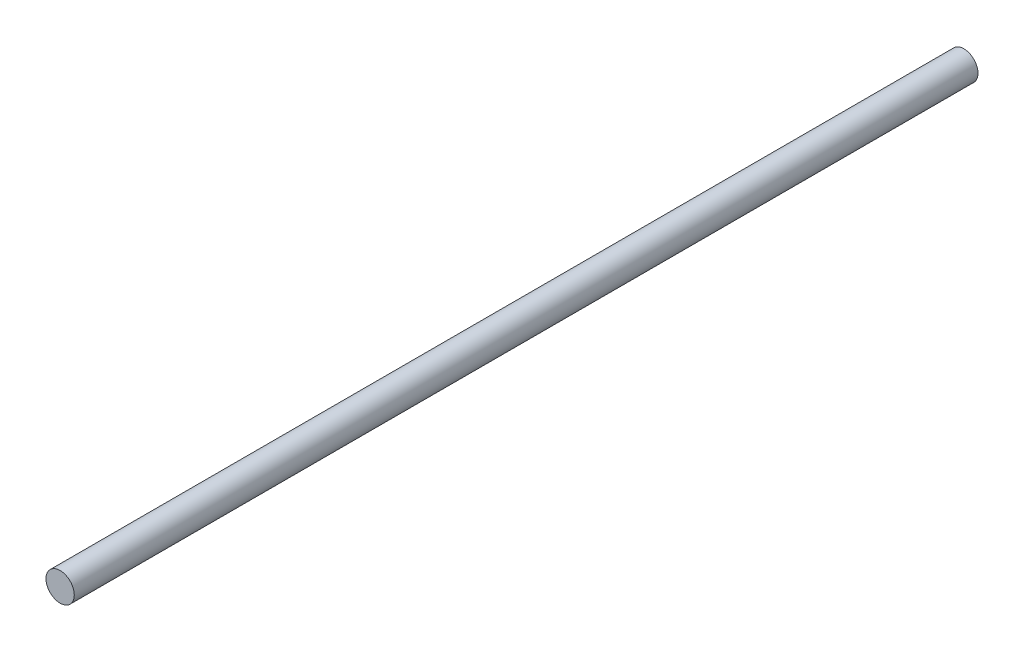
ISO-10303-21;
HEADER;
FILE_DESCRIPTION(('STEP AP214'),'2;1');
FILE_NAME('part.step','',(''),(''),'','','');
FILE_SCHEMA(('AUTOMOTIVE_DESIGN { 1 0 10303 214 1 1 1 1 }'));
ENDSEC;
DATA;
#1=APPLICATION_CONTEXT('core data for automotive mechanical design processes');
#2=APPLICATION_PROTOCOL_DEFINITION('international standard','automotive_design',2000,#1);
#3=PRODUCT_CONTEXT('',#1,'mechanical');
#4=PRODUCT('Part','Part','',(#3));
#5=PRODUCT_RELATED_PRODUCT_CATEGORY('part','',(#4));
#6=PRODUCT_DEFINITION_FORMATION('','',#4);
#7=PRODUCT_DEFINITION_CONTEXT('part definition',#1,'design');
#8=PRODUCT_DEFINITION('design','',#6,#7);
#9=PRODUCT_DEFINITION_SHAPE('','',#8);
#10=(LENGTH_UNIT() NAMED_UNIT(*) SI_UNIT(.MILLI.,.METRE.));
#11=(NAMED_UNIT(*) PLANE_ANGLE_UNIT() SI_UNIT($,.RADIAN.));
#12=(NAMED_UNIT(*) SI_UNIT($,.STERADIAN.) SOLID_ANGLE_UNIT());
#13=UNCERTAINTY_MEASURE_WITH_UNIT(LENGTH_MEASURE(1.E-05),#10,'distance_accuracy_value','');
#14=(GEOMETRIC_REPRESENTATION_CONTEXT(3) GLOBAL_UNCERTAINTY_ASSIGNED_CONTEXT((#13)) GLOBAL_UNIT_ASSIGNED_CONTEXT((#10,
#11,#12)) REPRESENTATION_CONTEXT('',''));
#15=CARTESIAN_POINT('',(0.,0.,0.));
#16=DIRECTION('',(0.,0.,1.));
#17=DIRECTION('',(1.,0.,0.));
#18=AXIS2_PLACEMENT_3D('',#15,#16,#17);
#19=CARTESIAN_POINT('',(0.,0.,510.8829));
#20=DIRECTION('',(0.,0.,-1.));
#21=DIRECTION('',(-1.,0.,0.));
#22=AXIS2_PLACEMENT_3D('',#19,#20,#21);
#23=CYLINDRICAL_SURFACE('',#22,8.001);
#24=CARTESIAN_POINT('',(0.,0.,510.8829));
#25=DIRECTION('',(0.,0.,1.));
#26=DIRECTION('',(1.,0.,0.));
#27=AXIS2_PLACEMENT_3D('',#24,#25,#26);
#28=CIRCLE('',#27,8.001);
#29=CARTESIAN_POINT('',(8.001,0.,510.8829));
#30=VERTEX_POINT('',#29);
#31=EDGE_CURVE('E10',#30,#30,#28,.T.);
#32=ORIENTED_EDGE('',*,*,#31,.F.);
#33=EDGE_LOOP('',(#32));
#34=FACE_BOUND('',#33,.T.);
#35=CARTESIAN_POINT('',(0.,0.,0.));
#36=DIRECTION('',(0.,0.,1.));
#37=DIRECTION('',(1.,0.,0.));
#38=AXIS2_PLACEMENT_3D('',#35,#36,#37);
#39=CIRCLE('',#38,8.001);
#40=CARTESIAN_POINT('',(8.001,0.,0.));
#41=VERTEX_POINT('',#40);
#42=EDGE_CURVE('E40',#41,#41,#39,.T.);
#43=ORIENTED_EDGE('',*,*,#42,.T.);
#44=EDGE_LOOP('',(#43));
#45=FACE_BOUND('',#44,.T.);
#46=ADVANCED_FACE('F37',(#34,#45),#23,.T.);
#47=CARTESIAN_POINT('',(0.,0.,510.8829));
#48=DIRECTION('',(0.,0.,1.));
#49=DIRECTION('',(1.,0.,0.));
#50=AXIS2_PLACEMENT_3D('',#47,#48,#49);
#51=PLANE('',#50);
#52=ORIENTED_EDGE('',*,*,#31,.T.);
#53=EDGE_LOOP('',(#52));
#54=FACE_BOUND('',#53,.T.);
#55=ADVANCED_FACE('F52',(#54),#51,.T.);
#56=CARTESIAN_POINT('',(0.,0.,0.));
#57=DIRECTION('',(0.,0.,1.));
#58=DIRECTION('',(1.,0.,0.));
#59=AXIS2_PLACEMENT_3D('',#56,#57,#58);
#60=PLANE('',#59);
#61=ORIENTED_EDGE('',*,*,#42,.F.);
#62=EDGE_LOOP('',(#61));
#63=FACE_BOUND('',#62,.T.);
#64=ADVANCED_FACE('F50',(#63),#60,.F.);
#65=CLOSED_SHELL('',(#46,#55,#64));
#66=MANIFOLD_SOLID_BREP('B2',#65);
#67=ADVANCED_BREP_SHAPE_REPRESENTATION('',(#18,#66),#14);
#68=SHAPE_DEFINITION_REPRESENTATION(#9,#67);
ENDSEC;
END-ISO-10303-21;
